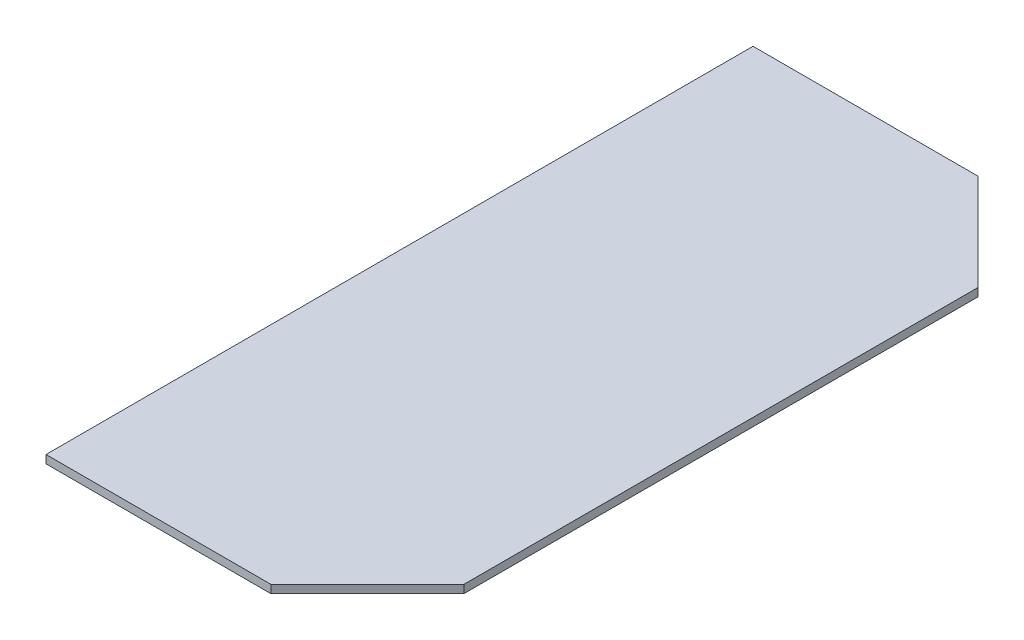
from build123d import *

# Parameters (mm, degrees)
BOSS_EXTRUDE1_DEPTH = 1.6002


with BuildPart() as part:
    # Sketch1 → Boss-Extrude1 (new body)
    with BuildSketch(Plane(origin=(0, 0, 0), x_dir=(1, 0, 0), z_dir=(0, 1, 0))):
        Polygon((0, 69.85), (0, -69.85), (44.45, -69.85), (63.5, -50.8), (63.5, 50.8), (44.45, 69.85), align=None)
    extrude(amount=BOSS_EXTRUDE1_DEPTH)


solid = part.part
